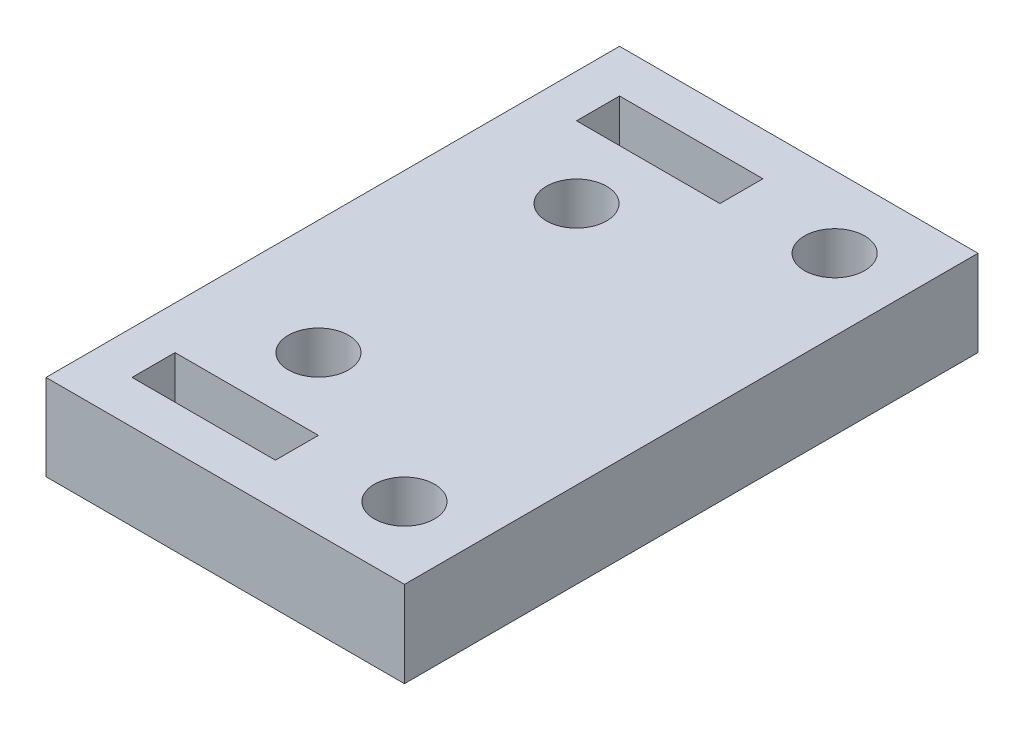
from build123d import *

# Parameters (mm, degrees)
SKETCH_1_W      = 25
SKETCH_1_H      = 40
SKETCH_1_R      = 2.1
SKETCH_1_W_2    = 10
SKETCH_1_H_2    = 3
EXTRUDE_1_DEPTH = 6


with BuildPart() as part:
    # Sketch 1 → Extrude 1 (new body)
    with BuildSketch(Plane(origin=(0, 0, 0), x_dir=(1, 0, 0), z_dir=(0, 1, 0))):
        with Locations((-12.5, 20)):
            Rectangle(SKETCH_1_W, SKETCH_1_H)
        with Locations(Location((-5, 5, 0), (0, 0, 270))):
            Circle(SKETCH_1_R, mode=Mode.SUBTRACT)
        with Locations(Location((-5, 35, 0), (0, 0, 270))):
            Circle(SKETCH_1_R, mode=Mode.SUBTRACT)
        with Locations(Location((-17, 29, 0), (0, 0, 270))):
            Circle(SKETCH_1_R, mode=Mode.SUBTRACT)
        with Locations(Location((-17, 11, 0), (0, 0, 270))):
            Circle(SKETCH_1_R, mode=Mode.SUBTRACT)
        with Locations((-17, 4.5)):
            Rectangle(SKETCH_1_W_2, SKETCH_1_H_2, mode=Mode.SUBTRACT)
        with Locations((-17, 35.5)):
            Rectangle(SKETCH_1_W_2, SKETCH_1_H_2, mode=Mode.SUBTRACT)
    extrude(amount=EXTRUDE_1_DEPTH)


solid = part.part
